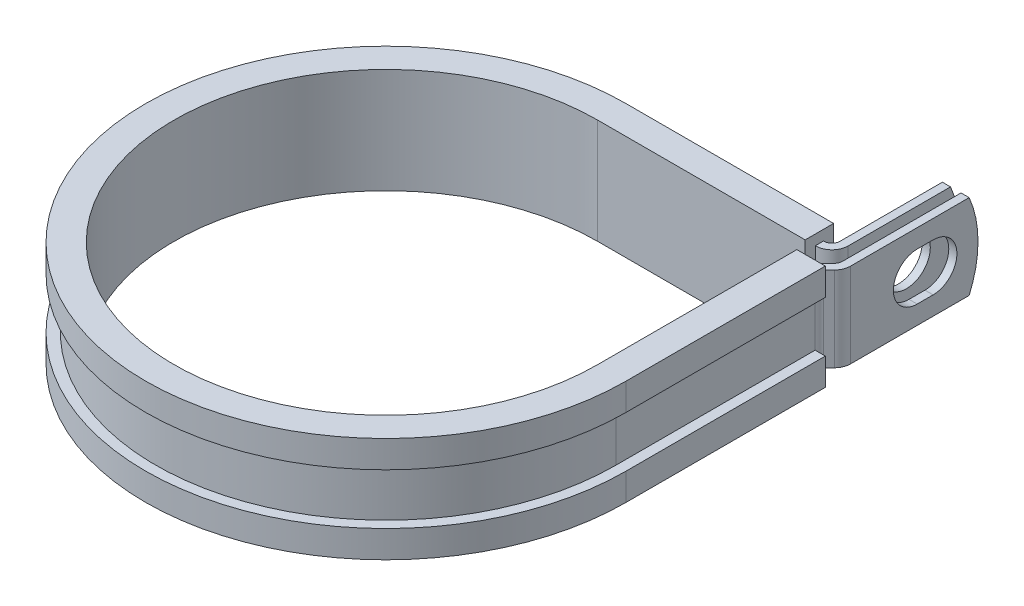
from build123d import *

# Parameters (mm, degrees)
EXTRUDE_THIN1_DEPTH = 6.35
SKETCH2_R           = 3.5687
CUT_EXTRUDE1_DEPTH  = 1.2192
CUT_EXTRUDE2_DEPTH  = 1.2192
CUT_EXTRUDE3_DEPTH  = 86.177043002


with BuildPart() as part:
    # Sketch1 → Extrude-Thin1 (new, symmetric)
    with BuildSketch(Plane(origin=(0, 0, 0), x_dir=(1, 0, 0), z_dir=(0, 1, 0))):
        with BuildLine():
            Line((35.1714698, 52.3748), (35.1714698, 33.274))
            ThreePointArc((35.1714698, 33.274), (35.078663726, 32.807432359), (34.814374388, 32.411895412))
            Line((34.814374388, 32.411895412), (33.988190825, 31.585711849))
            ThreePointArc((33.988190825, 31.585711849), (33.459612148, 30.794637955), (33.274, 29.861502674))
            Line((33.274, 29.861502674), (33.274, 0))
            ThreePointArc((33.274, 0), (-23.528271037, -23.528271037), (0, 33.274))
            Line((0, 33.274), (31.1582698, 33.274))
            ThreePointArc((31.1582698, 33.274), (32.882478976, 33.988190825), (33.5966698, 35.7124))
            Line((33.5966698, 35.7124), (33.5966698, 52.3748))
            Line((33.5966698, 52.3748), (32.3774698, 52.3748))
            Line((32.3774698, 52.3748), (32.3774698, 35.7124))
            ThreePointArc((32.3774698, 35.7124), (32.020374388, 34.850295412), (31.1582698, 34.4932))
            Line((31.1582698, 34.4932), (0, 34.4932))
            ThreePointArc((0, 34.4932), (-24.390375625, -24.390375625), (34.4932, 0))
            Line((34.4932, 0), (34.4932, 29.861502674))
            ThreePointArc((34.4932, 29.861502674), (34.586006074, 30.328070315), (34.850295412, 30.723607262))
            Line((34.850295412, 30.723607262), (35.676478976, 31.549790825))
            ThreePointArc((35.676478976, 31.549790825), (36.205057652, 32.340864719), (36.3906698, 33.274))
            Line((36.3906698, 33.274), (36.3906698, 52.3748))
            Line((36.3906698, 52.3748), (35.1714698, 52.3748))
        make_face()
    extrude(amount=EXTRUDE_THIN1_DEPTH, both=True)

    # Sketch2 → Cut-Extrude1 (cut)
    with BuildSketch(Plane.ZY.offset(-32.3774698)):
        with Locations((-44.45, 0)):
            Circle(SKETCH2_R)
    extrude(amount=-CUT_EXTRUDE1_DEPTH, mode=Mode.SUBTRACT)

    # Sketch3 → Cut-Extrude2 (cut)
    with BuildSketch(Plane(origin=(36.3906698, 0, 0), x_dir=(0, 0, -1), z_dir=(1, 0, 0))):
        with BuildLine():
            Line((43.2562, 3.5687), (45.6438, 3.5687))
            ThreePointArc((45.6438, 3.5687), (49.2125, 0), (45.6438, -3.5687))
            Line((45.6438, -3.5687), (43.2562, -3.5687))
            ThreePointArc((43.2562, -3.5687), (39.6875, 0), (43.2562, 3.5687))
        make_face()
    extrude(amount=-CUT_EXTRUDE2_DEPTH, mode=Mode.SUBTRACT)

    # Sketch4 → Cut-Extrude3 (cut, through all)
    with BuildSketch(Plane.ZY.offset(-32.3774698)):
        with BuildLine():
            Line((-51.049477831, 6.35), (-52.3748, 6.35))
            Line((-52.3748, 6.35), (-52.3748, 5.4e-08))
            ThreePointArc((-52.3748, 5.4e-08), (-52.039937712, 3.24341562), (-51.049477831, 6.35))
        make_face()
        with BuildLine():
            ThreePointArc((-51.049477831, -6.35), (-52.039937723, -3.243415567), (-52.3748, 5.4e-08))
            Line((-52.3748, 5.4e-08), (-52.3748, -6.35))
            Line((-52.3748, -6.35), (-51.049477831, -6.35))
        make_face()
    extrude(amount=-CUT_EXTRUDE3_DEPTH, mode=Mode.SUBTRACT)

    # Sweep1: sweep along a path in Sketch6
    with BuildLine(Plane(origin=(0, 6.35, 0), x_dir=(1, 0, 0), z_dir=(0, 1, 0))) as sweep1_path:
        Line((31.75, 29.861502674), (31.75, 0))
        ThreePointArc((31.75, 0), (-22.450640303, -22.450640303), (0, 31.75))
        Line((0, 31.75), (31.1074698, 31.75))
    # Sketch5 → Sweep1 (sweep)
    with BuildSketch(Plane(origin=(0, 0, -29.861502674), x_dir=(-1, 0, 0), z_dir=(0, 0, -1))):
        Polygon((-34.4932, 6.35), (-33.274, 6.35), (-33.274, -6.35), (-34.4932, -6.35), (-34.4932, -3.81), (-36.0172, -3.81), (-36.0172, -7.874), (-31.75, -7.874), (-31.75, 7.874), (-36.0172, 7.874), (-36.0172, 3.81), (-34.4932, 3.81), align=None)
    sweep(path=sweep1_path.line)


solid = part.part
